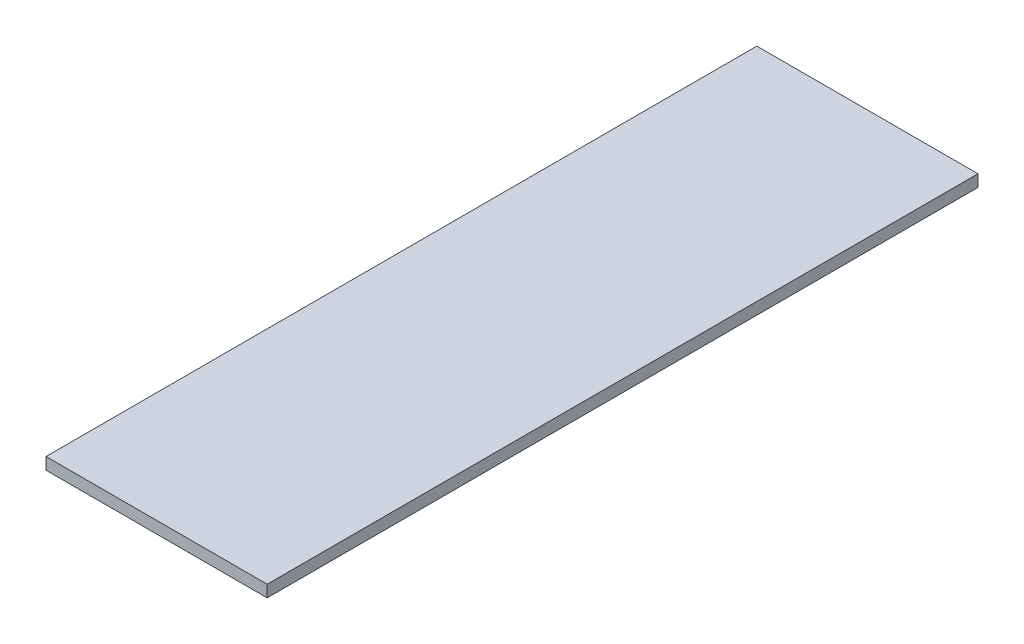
from build123d import *

# Parameters (mm, degrees)
SKETCH1_W           = 88.9
SKETCH1_H           = 285.75
BOSS_EXTRUDE1_DEPTH = 4.7625


with BuildPart() as part:
    # Sketch1 → Boss-Extrude1 (new body)
    with BuildSketch(Plane(origin=(0, 0, 0), x_dir=(1, 0, 0), z_dir=(0, 1, 0))):
        Rectangle(SKETCH1_W, SKETCH1_H)
    extrude(amount=BOSS_EXTRUDE1_DEPTH)


solid = part.part
